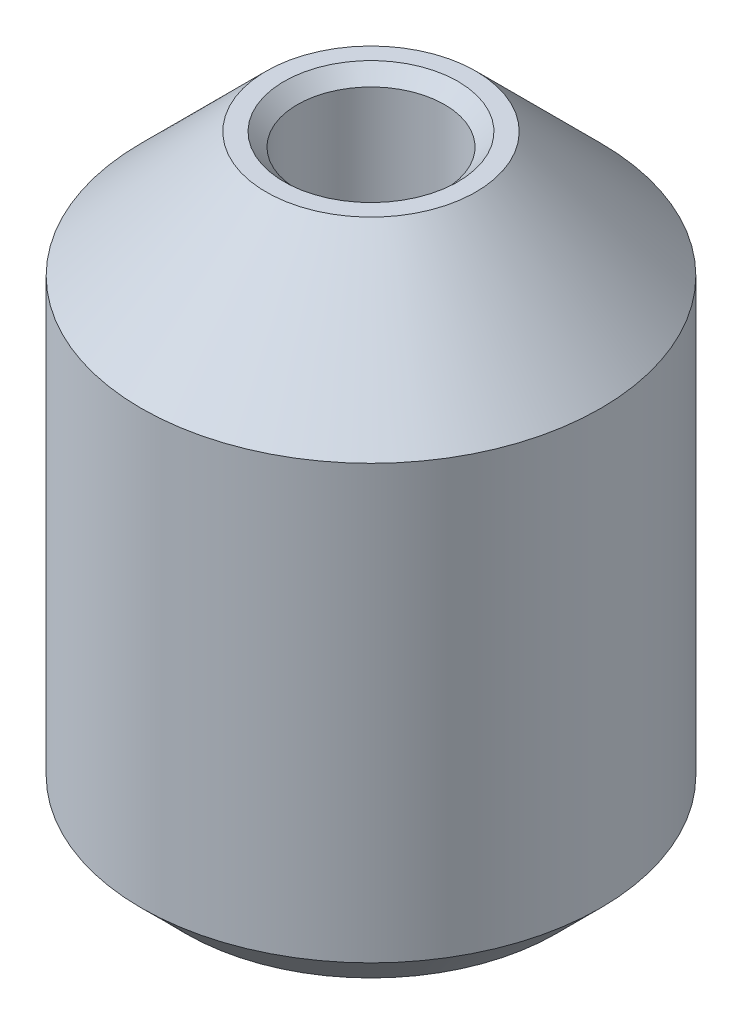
ISO-10303-21;
HEADER;
FILE_DESCRIPTION(('STEP AP214'),'2;1');
FILE_NAME('part.step','',(''),(''),'','','');
FILE_SCHEMA(('AUTOMOTIVE_DESIGN { 1 0 10303 214 1 1 1 1 }'));
ENDSEC;
DATA;
#1=APPLICATION_CONTEXT('core data for automotive mechanical design processes');
#2=APPLICATION_PROTOCOL_DEFINITION('international standard','automotive_design',2000,#1);
#3=PRODUCT_CONTEXT('',#1,'mechanical');
#4=PRODUCT('Part','Part','',(#3));
#5=PRODUCT_RELATED_PRODUCT_CATEGORY('part','',(#4));
#6=PRODUCT_DEFINITION_FORMATION('','',#4);
#7=PRODUCT_DEFINITION_CONTEXT('part definition',#1,'design');
#8=PRODUCT_DEFINITION('design','',#6,#7);
#9=PRODUCT_DEFINITION_SHAPE('','',#8);
#10=(LENGTH_UNIT() NAMED_UNIT(*) SI_UNIT(.MILLI.,.METRE.));
#11=(NAMED_UNIT(*) PLANE_ANGLE_UNIT() SI_UNIT($,.RADIAN.));
#12=(NAMED_UNIT(*) SI_UNIT($,.STERADIAN.) SOLID_ANGLE_UNIT());
#13=UNCERTAINTY_MEASURE_WITH_UNIT(LENGTH_MEASURE(1.E-05),#10,'distance_accuracy_value','');
#14=(GEOMETRIC_REPRESENTATION_CONTEXT(3) GLOBAL_UNCERTAINTY_ASSIGNED_CONTEXT((#13)) GLOBAL_UNIT_ASSIGNED_CONTEXT((#10,
#11,#12)) REPRESENTATION_CONTEXT('',''));
#15=CARTESIAN_POINT('',(0.,0.,0.));
#16=DIRECTION('',(0.,0.,1.));
#17=DIRECTION('',(1.,0.,0.));
#18=AXIS2_PLACEMENT_3D('',#15,#16,#17);
#19=CARTESIAN_POINT('',(0.,0.,0.));
#20=DIRECTION('',(0.,1.,0.));
#21=DIRECTION('',(0.,0.,1.));
#22=AXIS2_PLACEMENT_3D('',#19,#20,#21);
#23=PLANE('',#22);
#24=DIRECTION('',(0.,0.,1.));
#25=VECTOR('',#24,1.);
#26=CARTESIAN_POINT('',(-2.625,0.,0.));
#27=LINE('',#26,#25);
#28=CARTESIAN_POINT('',(-2.625,0.,-2.67803566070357));
#29=VERTEX_POINT('',#28);
#30=CARTESIAN_POINT('',(-2.625,0.,2.67803566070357));
#31=VERTEX_POINT('',#30);
#32=EDGE_CURVE('E153',#29,#31,#27,.T.);
#33=ORIENTED_EDGE('',*,*,#32,.T.);
#34=CARTESIAN_POINT('',(0.,0.,0.));
#35=DIRECTION('',(0.,1.,0.));
#36=DIRECTION('',(0.,0.,1.));
#37=AXIS2_PLACEMENT_3D('',#34,#35,#36);
#38=CIRCLE('',#37,3.75);
#39=CARTESIAN_POINT('',(2.625,0.,2.67803566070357));
#40=VERTEX_POINT('',#39);
#41=EDGE_CURVE('E155',#31,#40,#38,.T.);
#42=ORIENTED_EDGE('',*,*,#41,.T.);
#43=DIRECTION('',(0.,0.,-1.));
#44=VECTOR('',#43,1.);
#45=CARTESIAN_POINT('',(2.625,0.,0.));
#46=LINE('',#45,#44);
#47=CARTESIAN_POINT('',(2.625,0.,-2.67803566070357));
#48=VERTEX_POINT('',#47);
#49=EDGE_CURVE('E149',#40,#48,#46,.T.);
#50=ORIENTED_EDGE('',*,*,#49,.T.);
#51=CARTESIAN_POINT('',(0.,0.,0.));
#52=DIRECTION('',(0.,1.,0.));
#53=DIRECTION('',(0.,0.,1.));
#54=AXIS2_PLACEMENT_3D('',#51,#52,#53);
#55=CIRCLE('',#54,3.75);
#56=EDGE_CURVE('E151',#48,#29,#55,.T.);
#57=ORIENTED_EDGE('',*,*,#56,.T.);
#58=EDGE_LOOP('',(#33,#42,#50,#57));
#59=FACE_BOUND('',#58,.T.);
#60=CARTESIAN_POINT('',(0.,0.,0.));
#61=DIRECTION('',(0.,-1.,0.));
#62=DIRECTION('',(0.,0.,-1.));
#63=AXIS2_PLACEMENT_3D('',#60,#61,#62);
#64=CIRCLE('',#63,8.3);
#65=CARTESIAN_POINT('',(0.,0.,-8.3));
#66=VERTEX_POINT('',#65);
#67=EDGE_CURVE('E119',#66,#66,#64,.T.);
#68=ORIENTED_EDGE('',*,*,#67,.T.);
#69=EDGE_LOOP('',(#68));
#70=FACE_BOUND('',#69,.T.);
#71=ADVANCED_FACE('F33',(#59,#70),#23,.F.);
#72=CARTESIAN_POINT('',(-1.8,12.,0.));
#73=DIRECTION('',(0.,-1.,0.));
#74=DIRECTION('',(0.,0.,-1.));
#75=AXIS2_PLACEMENT_3D('',#72,#73,#74);
#76=PLANE('',#75);
#77=CARTESIAN_POINT('',(0.,12.,0.));
#78=DIRECTION('',(0.,-1.,0.));
#79=DIRECTION('',(0.,0.,-1.));
#80=AXIS2_PLACEMENT_3D('',#77,#78,#79);
#81=CIRCLE('',#80,1.8);
#82=CARTESIAN_POINT('',(0.,12.,-1.8));
#83=VERTEX_POINT('',#82);
#84=EDGE_CURVE('E137',#83,#83,#81,.T.);
#85=ORIENTED_EDGE('',*,*,#84,.F.);
#86=EDGE_LOOP('',(#85));
#87=FACE_BOUND('',#86,.T.);
#88=ADVANCED_FACE('F210',(#87),#76,.F.);
#89=CARTESIAN_POINT('',(0.,13.5,0.));
#90=DIRECTION('',(0.,-1.,0.));
#91=DIRECTION('',(0.,0.,-1.));
#92=AXIS2_PLACEMENT_3D('',#89,#90,#91);
#93=TOROIDAL_SURFACE('',#92,1.8,1.5);
#94=CARTESIAN_POINT('',(0.,13.5,0.));
#95=DIRECTION('',(0.,-1.,0.));
#96=DIRECTION('',(0.,0.,-1.));
#97=AXIS2_PLACEMENT_3D('',#94,#95,#96);
#98=CIRCLE('',#97,3.3);
#99=CARTESIAN_POINT('',(0.,13.5,-3.3));
#100=VERTEX_POINT('',#99);
#101=EDGE_CURVE('E134',#100,#100,#98,.T.);
#102=ORIENTED_EDGE('',*,*,#101,.F.);
#103=EDGE_LOOP('',(#102));
#104=FACE_BOUND('',#103,.T.);
#105=ORIENTED_EDGE('',*,*,#84,.T.);
#106=EDGE_LOOP('',(#105));
#107=FACE_BOUND('',#106,.T.);
#108=ADVANCED_FACE('F215',(#104,#107),#93,.F.);
#109=CARTESIAN_POINT('',(0.,0.,0.));
#110=DIRECTION('',(0.,-1.,0.));
#111=DIRECTION('',(0.,0.,-1.));
#112=AXIS2_PLACEMENT_3D('',#109,#110,#111);
#113=CYLINDRICAL_SURFACE('',#112,3.3);
#114=CARTESIAN_POINT('',(0.,26.4,0.));
#115=DIRECTION('',(0.,-1.,0.));
#116=DIRECTION('',(0.,0.,-1.));
#117=AXIS2_PLACEMENT_3D('',#114,#115,#116);
#118=CIRCLE('',#117,3.3);
#119=CARTESIAN_POINT('',(0.,26.4,-3.3));
#120=VERTEX_POINT('',#119);
#121=EDGE_CURVE('E143',#120,#120,#118,.F.);
#122=ORIENTED_EDGE('',*,*,#121,.T.);
#123=EDGE_LOOP('',(#122));
#124=FACE_BOUND('',#123,.T.);
#125=ORIENTED_EDGE('',*,*,#101,.T.);
#126=EDGE_LOOP('',(#125));
#127=FACE_BOUND('',#126,.T.);
#128=ADVANCED_FACE('F221',(#124,#127),#113,.F.);
#129=CARTESIAN_POINT('',(-4.7,27.,0.));
#130=DIRECTION('',(0.,-1.,0.));
#131=DIRECTION('',(0.,0.,-1.));
#132=AXIS2_PLACEMENT_3D('',#129,#130,#131);
#133=PLANE('',#132);
#134=CARTESIAN_POINT('',(0.,27.,0.));
#135=DIRECTION('',(0.,-1.,0.));
#136=DIRECTION('',(0.,0.,-1.));
#137=AXIS2_PLACEMENT_3D('',#134,#135,#136);
#138=CIRCLE('',#137,3.89999999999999);
#139=CARTESIAN_POINT('',(0.,27.,-3.89999999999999));
#140=VERTEX_POINT('',#139);
#141=EDGE_CURVE('E140',#140,#140,#138,.T.);
#142=ORIENTED_EDGE('',*,*,#141,.T.);
#143=EDGE_LOOP('',(#142));
#144=FACE_BOUND('',#143,.T.);
#145=CARTESIAN_POINT('',(0.,27.,0.));
#146=DIRECTION('',(0.,-1.,0.));
#147=DIRECTION('',(0.,0.,-1.));
#148=AXIS2_PLACEMENT_3D('',#145,#146,#147);
#149=CIRCLE('',#148,4.7);
#150=CARTESIAN_POINT('',(0.,27.,-4.7));
#151=VERTEX_POINT('',#150);
#152=EDGE_CURVE('E131',#151,#151,#149,.T.);
#153=ORIENTED_EDGE('',*,*,#152,.F.);
#154=EDGE_LOOP('',(#153));
#155=FACE_BOUND('',#154,.T.);
#156=ADVANCED_FACE('F225',(#144,#155),#133,.F.);
#157=CARTESIAN_POINT('',(0.,27.,0.));
#158=DIRECTION('',(0.,-1.,0.));
#159=DIRECTION('',(0.,0.,-1.));
#160=AXIS2_PLACEMENT_3D('',#157,#158,#159);
#161=CONICAL_SURFACE('',#160,4.7,0.785398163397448);
#162=CARTESIAN_POINT('',(0.,21.4,0.));
#163=DIRECTION('',(0.,-1.,0.));
#164=DIRECTION('',(0.,0.,-1.));
#165=AXIS2_PLACEMENT_3D('',#162,#163,#164);
#166=CIRCLE('',#165,10.3);
#167=CARTESIAN_POINT('',(0.,21.4,-10.3));
#168=VERTEX_POINT('',#167);
#169=EDGE_CURVE('E128',#168,#168,#166,.T.);
#170=ORIENTED_EDGE('',*,*,#169,.F.);
#171=EDGE_LOOP('',(#170));
#172=FACE_BOUND('',#171,.T.);
#173=ORIENTED_EDGE('',*,*,#152,.T.);
#174=EDGE_LOOP('',(#173));
#175=FACE_BOUND('',#174,.T.);
#176=ADVANCED_FACE('F229',(#172,#175),#161,.T.);
#177=CARTESIAN_POINT('',(0.,0.,0.));
#178=DIRECTION('',(0.,-1.,0.));
#179=DIRECTION('',(0.,0.,-1.));
#180=AXIS2_PLACEMENT_3D('',#177,#178,#179);
#181=CYLINDRICAL_SURFACE('',#180,10.3);
#182=CARTESIAN_POINT('',(0.,2.,0.));
#183=DIRECTION('',(0.,-1.,0.));
#184=DIRECTION('',(0.,0.,-1.));
#185=AXIS2_PLACEMENT_3D('',#182,#183,#184);
#186=CIRCLE('',#185,10.3);
#187=CARTESIAN_POINT('',(0.,2.,-10.3));
#188=VERTEX_POINT('',#187);
#189=EDGE_CURVE('E125',#188,#188,#186,.T.);
#190=ORIENTED_EDGE('',*,*,#189,.F.);
#191=EDGE_LOOP('',(#190));
#192=FACE_BOUND('',#191,.T.);
#193=ORIENTED_EDGE('',*,*,#169,.T.);
#194=EDGE_LOOP('',(#193));
#195=FACE_BOUND('',#194,.T.);
#196=ADVANCED_FACE('F233',(#192,#195),#181,.T.);
#197=CARTESIAN_POINT('',(0.,2.,0.));
#198=DIRECTION('',(0.,1.,0.));
#199=DIRECTION('',(0.,0.,1.));
#200=AXIS2_PLACEMENT_3D('',#197,#198,#199);
#201=CONICAL_SURFACE('',#200,10.3,0.785398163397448);
#202=ORIENTED_EDGE('',*,*,#67,.F.);
#203=EDGE_LOOP('',(#202));
#204=FACE_BOUND('',#203,.T.);
#205=ORIENTED_EDGE('',*,*,#189,.T.);
#206=EDGE_LOOP('',(#205));
#207=FACE_BOUND('',#206,.T.);
#208=ADVANCED_FACE('F237',(#204,#207),#201,.T.);
#209=CARTESIAN_POINT('',(0.,9.,0.));
#210=DIRECTION('',(0.,-1.,0.));
#211=DIRECTION('',(0.,0.,-1.));
#212=AXIS2_PLACEMENT_3D('',#209,#210,#211);
#213=CYLINDRICAL_SURFACE('',#212,3.);
#214=DIRECTION('',(0.,-1.,0.));
#215=VECTOR('',#214,1.);
#216=CARTESIAN_POINT('',(-1.875,9.,-2.3418742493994));
#217=LINE('',#216,#215);
#218=CARTESIAN_POINT('',(-1.875,9.,-2.3418742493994));
#219=VERTEX_POINT('',#218);
#220=CARTESIAN_POINT('',(-1.875,0.750000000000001,-2.3418742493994));
#221=VERTEX_POINT('',#220);
#222=EDGE_CURVE('E117',#219,#221,#217,.T.);
#223=ORIENTED_EDGE('',*,*,#222,.T.);
#224=CARTESIAN_POINT('',(0.,0.750000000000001,0.));
#225=DIRECTION('',(0.,1.,0.));
#226=DIRECTION('',(0.,0.,1.));
#227=AXIS2_PLACEMENT_3D('',#224,#225,#226);
#228=CIRCLE('',#227,3.);
#229=CARTESIAN_POINT('',(1.875,0.750000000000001,-2.3418742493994));
#230=VERTEX_POINT('',#229);
#231=EDGE_CURVE('E46',#221,#230,#228,.F.);
#232=ORIENTED_EDGE('',*,*,#231,.T.);
#233=DIRECTION('',(0.,-1.,0.));
#234=VECTOR('',#233,1.);
#235=CARTESIAN_POINT('',(1.875,9.,-2.3418742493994));
#236=LINE('',#235,#234);
#237=CARTESIAN_POINT('',(1.875,9.,-2.3418742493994));
#238=VERTEX_POINT('',#237);
#239=EDGE_CURVE('E89',#238,#230,#236,.T.);
#240=ORIENTED_EDGE('',*,*,#239,.F.);
#241=CARTESIAN_POINT('',(0.,9.,0.));
#242=DIRECTION('',(0.,-1.,0.));
#243=DIRECTION('',(0.,0.,-1.));
#244=AXIS2_PLACEMENT_3D('',#241,#242,#243);
#245=CIRCLE('',#244,3.);
#246=EDGE_CURVE('E93',#219,#238,#245,.T.);
#247=ORIENTED_EDGE('',*,*,#246,.F.);
#248=EDGE_LOOP('',(#223,#232,#240,#247));
#249=FACE_BOUND('',#248,.T.);
#250=ADVANCED_FACE('F91',(#249),#213,.F.);
#251=CARTESIAN_POINT('',(-1.875,9.,-2.3418742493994));
#252=DIRECTION('',(-1.,0.,0.));
#253=DIRECTION('',(0.,0.,1.));
#254=AXIS2_PLACEMENT_3D('',#251,#252,#253);
#255=PLANE('',#254);
#256=DIRECTION('',(0.,-1.,0.));
#257=VECTOR('',#256,1.);
#258=CARTESIAN_POINT('',(-1.875,9.,2.3418742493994));
#259=LINE('',#258,#257);
#260=CARTESIAN_POINT('',(-1.875,9.,2.3418742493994));
#261=VERTEX_POINT('',#260);
#262=CARTESIAN_POINT('',(-1.875,0.750000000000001,2.3418742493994));
#263=VERTEX_POINT('',#262);
#264=EDGE_CURVE('E120',#261,#263,#259,.T.);
#265=ORIENTED_EDGE('',*,*,#264,.T.);
#266=DIRECTION('',(0.,0.,-1.));
#267=VECTOR('',#266,1.);
#268=CARTESIAN_POINT('',(-1.875,0.750000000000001,-2.3418742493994));
#269=LINE('',#268,#267);
#270=EDGE_CURVE('E61',#263,#221,#269,.T.);
#271=ORIENTED_EDGE('',*,*,#270,.T.);
#272=ORIENTED_EDGE('',*,*,#222,.F.);
#273=DIRECTION('',(0.,0.,-1.));
#274=VECTOR('',#273,1.);
#275=CARTESIAN_POINT('',(-1.875,9.,-2.3418742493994));
#276=LINE('',#275,#274);
#277=EDGE_CURVE('E98',#261,#219,#276,.T.);
#278=ORIENTED_EDGE('',*,*,#277,.F.);
#279=EDGE_LOOP('',(#265,#271,#272,#278));
#280=FACE_BOUND('',#279,.T.);
#281=ADVANCED_FACE('F200',(#280),#255,.F.);
#282=CARTESIAN_POINT('',(0.,9.,0.));
#283=DIRECTION('',(0.,-1.,0.));
#284=DIRECTION('',(0.,0.,-1.));
#285=AXIS2_PLACEMENT_3D('',#282,#283,#284);
#286=CYLINDRICAL_SURFACE('',#285,3.);
#287=DIRECTION('',(0.,-1.,0.));
#288=VECTOR('',#287,1.);
#289=CARTESIAN_POINT('',(1.875,9.,2.3418742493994));
#290=LINE('',#289,#288);
#291=CARTESIAN_POINT('',(1.875,9.,2.3418742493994));
#292=VERTEX_POINT('',#291);
#293=CARTESIAN_POINT('',(1.875,0.750000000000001,2.3418742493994));
#294=VERTEX_POINT('',#293);
#295=EDGE_CURVE('E97',#292,#294,#290,.T.);
#296=ORIENTED_EDGE('',*,*,#295,.T.);
#297=CARTESIAN_POINT('',(0.,0.750000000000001,0.));
#298=DIRECTION('',(0.,1.,0.));
#299=DIRECTION('',(0.,0.,1.));
#300=AXIS2_PLACEMENT_3D('',#297,#298,#299);
#301=CIRCLE('',#300,3.);
#302=EDGE_CURVE('E146',#294,#263,#301,.F.);
#303=ORIENTED_EDGE('',*,*,#302,.T.);
#304=ORIENTED_EDGE('',*,*,#264,.F.);
#305=CARTESIAN_POINT('',(0.,9.,0.));
#306=DIRECTION('',(0.,-1.,0.));
#307=DIRECTION('',(0.,0.,-1.));
#308=AXIS2_PLACEMENT_3D('',#305,#306,#307);
#309=CIRCLE('',#308,3.);
#310=EDGE_CURVE('E107',#292,#261,#309,.T.);
#311=ORIENTED_EDGE('',*,*,#310,.F.);
#312=EDGE_LOOP('',(#296,#303,#304,#311));
#313=FACE_BOUND('',#312,.T.);
#314=ADVANCED_FACE('F199',(#313),#286,.F.);
#315=CARTESIAN_POINT('',(1.875,9.,-2.3418742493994));
#316=DIRECTION('',(1.,0.,0.));
#317=DIRECTION('',(0.,0.,-1.));
#318=AXIS2_PLACEMENT_3D('',#315,#316,#317);
#319=PLANE('',#318);
#320=ORIENTED_EDGE('',*,*,#239,.T.);
#321=DIRECTION('',(0.,0.,1.));
#322=VECTOR('',#321,1.);
#323=CARTESIAN_POINT('',(1.875,0.750000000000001,-2.3418742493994));
#324=LINE('',#323,#322);
#325=EDGE_CURVE('E11',#230,#294,#324,.T.);
#326=ORIENTED_EDGE('',*,*,#325,.T.);
#327=ORIENTED_EDGE('',*,*,#295,.F.);
#328=DIRECTION('',(0.,0.,1.));
#329=VECTOR('',#328,1.);
#330=CARTESIAN_POINT('',(1.875,9.,-2.3418742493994));
#331=LINE('',#330,#329);
#332=EDGE_CURVE('E101',#238,#292,#331,.T.);
#333=ORIENTED_EDGE('',*,*,#332,.F.);
#334=EDGE_LOOP('',(#320,#326,#327,#333));
#335=FACE_BOUND('',#334,.T.);
#336=ADVANCED_FACE('F102',(#335),#319,.F.);
#337=CARTESIAN_POINT('',(0.,9.,0.));
#338=DIRECTION('',(0.,-1.,0.));
#339=DIRECTION('',(0.,0.,-1.));
#340=AXIS2_PLACEMENT_3D('',#337,#338,#339);
#341=PLANE('',#340);
#342=ORIENTED_EDGE('',*,*,#246,.T.);
#343=ORIENTED_EDGE('',*,*,#332,.T.);
#344=ORIENTED_EDGE('',*,*,#310,.T.);
#345=ORIENTED_EDGE('',*,*,#277,.T.);
#346=EDGE_LOOP('',(#342,#343,#344,#345));
#347=FACE_BOUND('',#346,.T.);
#348=ADVANCED_FACE('F109',(#347),#341,.T.);
#349=CARTESIAN_POINT('',(0.,27.,0.));
#350=DIRECTION('',(0.,1.,0.));
#351=DIRECTION('',(0.,0.,1.));
#352=AXIS2_PLACEMENT_3D('',#349,#350,#351);
#353=CONICAL_SURFACE('',#352,3.89999999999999,0.785398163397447);
#354=ORIENTED_EDGE('',*,*,#121,.F.);
#355=EDGE_LOOP('',(#354));
#356=FACE_BOUND('',#355,.T.);
#357=ORIENTED_EDGE('',*,*,#141,.F.);
#358=EDGE_LOOP('',(#357));
#359=FACE_BOUND('',#358,.T.);
#360=ADVANCED_FACE('F203',(#356,#359),#353,.F.);
#361=CARTESIAN_POINT('',(0.,0.750000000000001,0.));
#362=DIRECTION('',(0.,-1.,0.));
#363=DIRECTION('',(0.,0.,-1.));
#364=AXIS2_PLACEMENT_3D('',#361,#362,#363);
#365=CONICAL_SURFACE('',#364,3.,0.785398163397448);
#366=CARTESIAN_POINT('',(-1.875,0.750000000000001,-2.3418742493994));
#367=CARTESIAN_POINT('',(-1.93708865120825,0.687911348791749,-2.37169797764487));
#368=CARTESIAN_POINT('',(-1.99929811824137,0.625701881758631,-2.40101541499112));
#369=CARTESIAN_POINT('',(-2.12392653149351,0.501073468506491,-2.45871821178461));
#370=CARTESIAN_POINT('',(-2.18634545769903,0.438654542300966,-2.48710365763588));
#371=CARTESIAN_POINT('',(-2.31137063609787,0.31362936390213,-2.54302779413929));
#372=CARTESIAN_POINT('',(-2.37397688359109,0.251023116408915,-2.57056650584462));
#373=CARTESIAN_POINT('',(-2.49936396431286,0.125636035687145,-2.62486743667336));
#374=CARTESIAN_POINT('',(-2.56214481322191,0.0628551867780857,-2.65162958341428));
#375=CARTESIAN_POINT('',(-2.625,0.,-2.67803566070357));
#376=B_SPLINE_CURVE_WITH_KNOTS('',3,(#366,#367,#368,#369,#370,#371,#372,#373,#374,#375),
.UNSPECIFIED.,.F.,.F.,(4,2,2,2,4),(0.,0.27819670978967,0.556367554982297,0.834531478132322,
1.11272124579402),.UNSPECIFIED.);
#377=EDGE_CURVE('E113',#29,#221,#376,.F.);
#378=ORIENTED_EDGE('',*,*,#377,.F.);
#379=ORIENTED_EDGE('',*,*,#56,.F.);
#380=CARTESIAN_POINT('',(1.875,0.750000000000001,-2.3418742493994));
#381=CARTESIAN_POINT('',(1.93708865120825,0.687911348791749,-2.37169797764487));
#382=CARTESIAN_POINT('',(1.99929811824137,0.625701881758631,-2.40101541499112));
#383=CARTESIAN_POINT('',(2.12392653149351,0.501073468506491,-2.45871821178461));
#384=CARTESIAN_POINT('',(2.18634545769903,0.438654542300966,-2.48710365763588));
#385=CARTESIAN_POINT('',(2.31137063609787,0.31362936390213,-2.54302779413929));
#386=CARTESIAN_POINT('',(2.37397688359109,0.251023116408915,-2.57056650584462));
#387=CARTESIAN_POINT('',(2.49936396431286,0.125636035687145,-2.62486743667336));
#388=CARTESIAN_POINT('',(2.56214481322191,0.0628551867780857,-2.65162958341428));
#389=CARTESIAN_POINT('',(2.625,0.,-2.67803566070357));
#390=B_SPLINE_CURVE_WITH_KNOTS('',3,(#380,#381,#382,#383,#384,#385,#386,#387,#388,#389),
.UNSPECIFIED.,.F.,.F.,(4,2,2,2,4),(0.,0.27819670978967,0.556367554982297,0.834531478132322,
1.11272124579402),.UNSPECIFIED.);
#391=EDGE_CURVE('E38',#230,#48,#390,.T.);
#392=ORIENTED_EDGE('',*,*,#391,.F.);
#393=ORIENTED_EDGE('',*,*,#231,.F.);
#394=EDGE_LOOP('',(#378,#379,#392,#393));
#395=FACE_BOUND('',#394,.T.);
#396=ADVANCED_FACE('F35',(#395),#365,.F.);
#397=CARTESIAN_POINT('',(1.875,0.750000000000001,-2.3418742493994));
#398=DIRECTION('',(0.707106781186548,0.707106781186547,0.));
#399=DIRECTION('',(0.,0.,1.));
#400=AXIS2_PLACEMENT_3D('',#397,#398,#399);
#401=PLANE('',#400);
#402=ORIENTED_EDGE('',*,*,#391,.T.);
#403=ORIENTED_EDGE('',*,*,#49,.F.);
#404=CARTESIAN_POINT('',(2.625,0.,2.67803566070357));
#405=CARTESIAN_POINT('',(2.56214481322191,0.0628551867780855,2.65162958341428));
#406=CARTESIAN_POINT('',(2.49936396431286,0.125636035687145,2.62486743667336));
#407=CARTESIAN_POINT('',(2.37397688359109,0.251023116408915,2.57056650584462));
#408=CARTESIAN_POINT('',(2.31137063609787,0.31362936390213,2.54302779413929));
#409=CARTESIAN_POINT('',(2.18634545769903,0.438654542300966,2.48710365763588));
#410=CARTESIAN_POINT('',(2.12392653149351,0.501073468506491,2.45871821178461));
#411=CARTESIAN_POINT('',(1.99929811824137,0.625701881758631,2.40101541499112));
#412=CARTESIAN_POINT('',(1.93708865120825,0.687911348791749,2.37169797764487));
#413=CARTESIAN_POINT('',(1.875,0.750000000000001,2.3418742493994));
#414=B_SPLINE_CURVE_WITH_KNOTS('',3,(#404,#405,#406,#407,#408,#409,#410,#411,#412,#413),
.UNSPECIFIED.,.F.,.F.,(4,2,2,2,4),(0.,0.278189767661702,0.556353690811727,0.834524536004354,
1.11272124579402),.UNSPECIFIED.);
#415=EDGE_CURVE('E167',#294,#40,#414,.F.);
#416=ORIENTED_EDGE('',*,*,#415,.F.);
#417=ORIENTED_EDGE('',*,*,#325,.F.);
#418=EDGE_LOOP('',(#402,#403,#416,#417));
#419=FACE_BOUND('',#418,.T.);
#420=ADVANCED_FACE('F177',(#419),#401,.F.);
#421=CARTESIAN_POINT('',(-1.875,0.750000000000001,-2.3418742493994));
#422=DIRECTION('',(-0.707106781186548,0.707106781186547,0.));
#423=DIRECTION('',(0.,0.,-1.));
#424=AXIS2_PLACEMENT_3D('',#421,#422,#423);
#425=PLANE('',#424);
#426=ORIENTED_EDGE('',*,*,#377,.T.);
#427=ORIENTED_EDGE('',*,*,#270,.F.);
#428=CARTESIAN_POINT('',(-1.875,0.750000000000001,2.3418742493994));
#429=CARTESIAN_POINT('',(-1.93708865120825,0.687911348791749,2.37169797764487));
#430=CARTESIAN_POINT('',(-1.99929811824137,0.625701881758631,2.40101541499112));
#431=CARTESIAN_POINT('',(-2.12392653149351,0.501073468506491,2.45871821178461));
#432=CARTESIAN_POINT('',(-2.18634545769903,0.438654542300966,2.48710365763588));
#433=CARTESIAN_POINT('',(-2.31137063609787,0.31362936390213,2.54302779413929));
#434=CARTESIAN_POINT('',(-2.37397688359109,0.251023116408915,2.57056650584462));
#435=CARTESIAN_POINT('',(-2.49936396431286,0.125636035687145,2.62486743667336));
#436=CARTESIAN_POINT('',(-2.56214481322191,0.0628551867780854,2.65162958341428));
#437=CARTESIAN_POINT('',(-2.625,0.,2.67803566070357));
#438=B_SPLINE_CURVE_WITH_KNOTS('',3,(#428,#429,#430,#431,#432,#433,#434,#435,#436,#437),
.UNSPECIFIED.,.F.,.F.,(4,2,2,2,4),(0.,0.27819670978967,0.556367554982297,0.834531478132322,
1.11272124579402),.UNSPECIFIED.);
#439=EDGE_CURVE('E160',#31,#263,#438,.F.);
#440=ORIENTED_EDGE('',*,*,#439,.F.);
#441=ORIENTED_EDGE('',*,*,#32,.F.);
#442=EDGE_LOOP('',(#426,#427,#440,#441));
#443=FACE_BOUND('',#442,.T.);
#444=ADVANCED_FACE('F174',(#443),#425,.F.);
#445=CARTESIAN_POINT('',(0.,0.750000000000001,0.));
#446=DIRECTION('',(0.,-1.,0.));
#447=DIRECTION('',(0.,0.,-1.));
#448=AXIS2_PLACEMENT_3D('',#445,#446,#447);
#449=CONICAL_SURFACE('',#448,3.,0.785398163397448);
#450=ORIENTED_EDGE('',*,*,#415,.T.);
#451=ORIENTED_EDGE('',*,*,#41,.F.);
#452=ORIENTED_EDGE('',*,*,#439,.T.);
#453=ORIENTED_EDGE('',*,*,#302,.F.);
#454=EDGE_LOOP('',(#450,#451,#452,#453));
#455=FACE_BOUND('',#454,.T.);
#456=ADVANCED_FACE('F171',(#455),#449,.F.);
#457=CLOSED_SHELL('',(#71,#88,#108,#128,#156,#176,#196,#208,#250,#281,#314,#336,#348,#360,#396,
#420,#444,#456));
#458=MANIFOLD_SOLID_BREP('B2',#457);
#459=ADVANCED_BREP_SHAPE_REPRESENTATION('',(#18,#458),#14);
#460=SHAPE_DEFINITION_REPRESENTATION(#9,#459);
ENDSEC;
END-ISO-10303-21;
